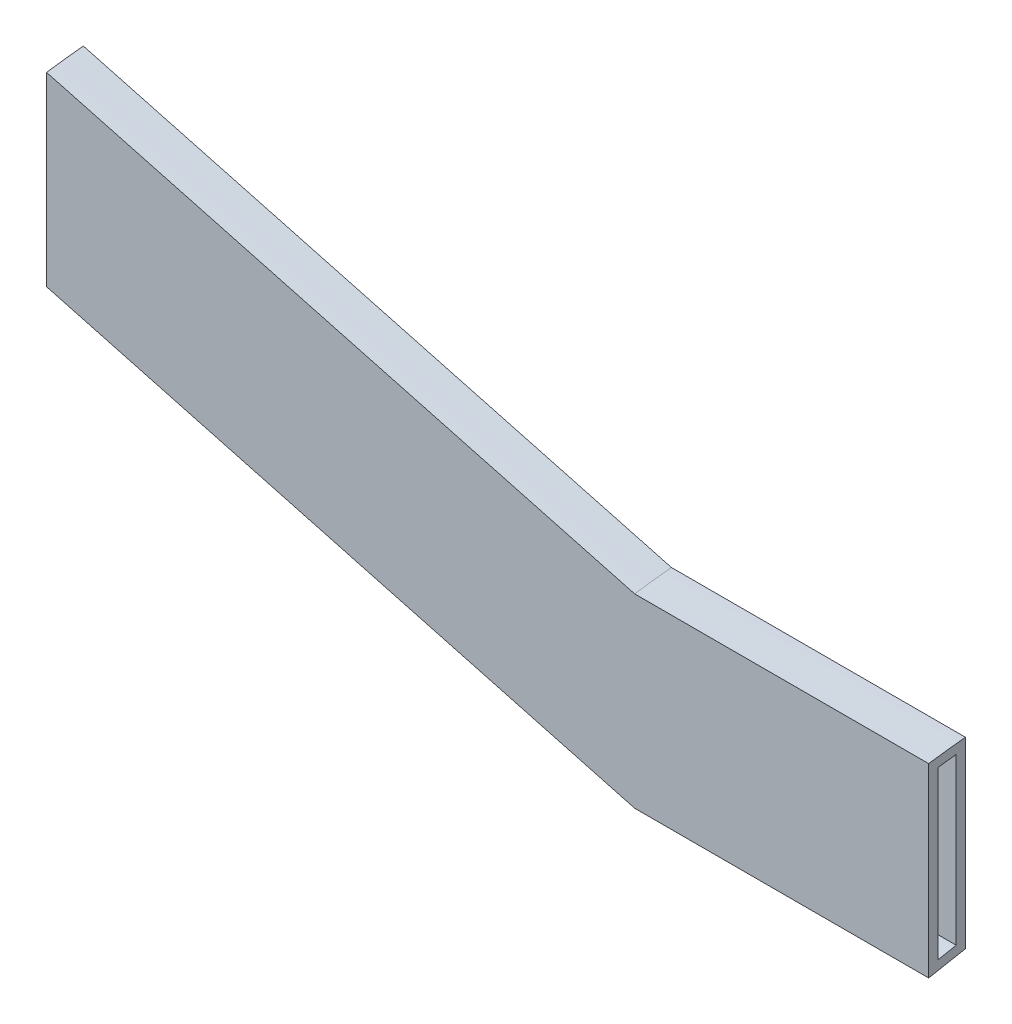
from build123d import *

# Parameters (mm, degrees)
BOSS_EXTRUDE1_DEPTH = 25.4
SKETCH9_W           = 16.830839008
SKETCH9_H           = 32.414949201
CUT_EXTRUDE1_DEPTH  = 91.11403136


with BuildPart() as part:
    # Sketch1 → Boss-Extrude1 (new body)
    with BuildSketch(Plane(origin=(0, 0, 0), x_dir=(0, 0, -1), z_dir=(1, 0, 0))):
        with BuildLine():
            Line((32.54375, 18.223643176), (32.54375, 2.186214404))
            add(Edge.make_bspline(
                [(32.54375, 2.186214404), (33.60192669, 2.387238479), (34.660215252, 2.587677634), (35.71875, 2.786807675)],
                knots=[0.623360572, 0.623360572, 0.623360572, 0.623360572, 0.633917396, 0.633917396, 0.633917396, 0.633917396], degree=3))
            Line((35.71875, 2.786807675), (35.71875, 18.610370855))
            add(Edge.make_bspline(
                [(35.71875, 18.610370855), (34.657913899, 18.504004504), (33.599137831, 18.374784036), (32.54375, 18.223643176)],
                knots=[0.37069791, 0.37069791, 0.37069791, 0.37069791, 0.381261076, 0.381261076, 0.381261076, 0.381261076], degree=3))
        make_face()
        with BuildLine():
            Line((33.3375, 17.532319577), (33.3375, 3.14477122))
            add(Edge.make_bspline(
                [(33.3375, 3.14477122), (33.866623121, 3.245077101), (34.395784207, 3.345183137), (34.925, 3.444998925)],
                knots=[0.626491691, 0.626491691, 0.626491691, 0.626491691, 0.631767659, 0.631767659, 0.631767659, 0.631767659], degree=3))
            Line((34.925, 3.444998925), (34.925, 17.727804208))
            add(Edge.make_bspline(
                [(34.925, 17.727804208), (34.395165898, 17.668312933), (33.865942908, 17.603111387), (33.3375, 17.532319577)],
                knots=[0.373628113, 0.373628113, 0.373628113, 0.373628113, 0.378966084, 0.378966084, 0.378966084, 0.378966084], degree=3))
        make_face(mode=Mode.SUBTRACT)
    boss_extrude1 = extrude(amount=BOSS_EXTRUDE1_DEPTH)

    # Sweep1: sweep along a path in Sketch4
    with BuildLine(Plane.XY.offset(-32.54375)) as sweep1_path:
        Line((25.4, 2.186214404), (76.2, 15.79803338))
    # Sketch7 → Sweep1 (sweep)
    with BuildSketch(Plane(origin=(25.4, 0, 0), x_dir=(0, 0, -1), z_dir=(1, 0, 0))):
        with BuildLine():
            Line((32.54375, 18.223643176), (32.54375, 2.186214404))
            add(Edge.make_bspline(
                [(32.54375, 2.186214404), (33.60192669, 2.387238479), (34.660215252, 2.587677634), (35.71875, 2.786807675)],
                knots=[0.623360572, 0.623360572, 0.623360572, 0.623360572, 0.633917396, 0.633917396, 0.633917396, 0.633917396], degree=3))
            Line((35.71875, 2.786807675), (35.71875, 18.610370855))
            add(Edge.make_bspline(
                [(35.71875, 18.610370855), (34.657913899, 18.504004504), (33.599137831, 18.374784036), (32.54375, 18.223643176)],
                knots=[0.37069791, 0.37069791, 0.37069791, 0.37069791, 0.381261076, 0.381261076, 0.381261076, 0.381261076], degree=3))
        make_face()
        with BuildLine():
            Line((33.3375, 17.532319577), (33.3375, 3.14477122))
            ThreePointArc((33.3375, 3.14477122), (34.131215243, 3.295068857), (34.925, 3.444998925))
            Line((34.925, 3.444998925), (34.925, 17.727804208))
            ThreePointArc((34.925, 17.727804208), (34.130728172, 17.634299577), (33.3375, 17.532319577))
        make_face(mode=Mode.SUBTRACT)
    sweep1 = sweep(path=sweep1_path.line)

    # Mirror1: Boss-Extrude1, Sweep1 across plane
    add(boss_extrude1.mirror(Plane(origin=(0, 0, 0), x_dir=(0, 0, 1), z_dir=(1, 0, 0))))
    add(sweep1.mirror(Plane(origin=(0, 0, 0), x_dir=(0, 0, 1), z_dir=(1, 0, 0))))

    # Sketch9 → Cut-Extrude1 (cut, through all)
    with BuildSketch(Plane(origin=(0, 0, 0), x_dir=(0, 0, -1), z_dir=(1, 0, 0))):
        with Locations((31.414205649, 17.428223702)):
            Rectangle(SKETCH9_W, SKETCH9_H)
    extrude(amount=CUT_EXTRUDE1_DEPTH, mode=Mode.SUBTRACT)


solid = part.part
